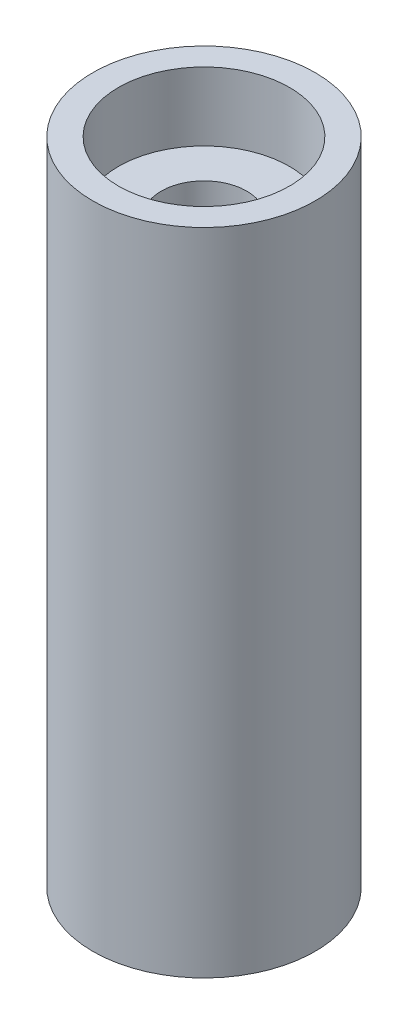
from build123d import *

# Parameters (mm, degrees)
SKETCH_1_R          = 6.5
SKETCH_1_R_2        = 2.5
EXTRUDE_2_DEPTH     = 19
SKETCH_2_R          = 5
CUT_EXTRUDE_1_DEPTH = 4


with BuildPart() as part:
    # Sketch 1 → Extrude 2 (new, symmetric)
    with BuildSketch(Plane(origin=(0, 0, 0), x_dir=(1, 0, 0), z_dir=(0, 1, 0))):
        with Locations(Location((0, 0, 0), (0, 0, 270))):
            Circle(SKETCH_1_R)
        with Locations(Location((0, 0, 0), (0, 0, 270))):
            Circle(SKETCH_1_R_2, mode=Mode.SUBTRACT)
    extrude(amount=EXTRUDE_2_DEPTH, both=True)

    # Sketch 2 → Cut-Extrude 1 (cut)
    with BuildSketch(Plane(origin=(0, 19, 0), x_dir=(1, 0, 0), z_dir=(0, 1, 0))):
        with Locations(Location((0, 0, 0), (0, 0, 270))):
            Circle(SKETCH_2_R)
    cut_extrude_1 = extrude(amount=-CUT_EXTRUDE_1_DEPTH, mode=Mode.SUBTRACT)

    # Mirror 1: Cut-Extrude 1 across plane
    add(cut_extrude_1.mirror(Plane.ZX), mode=Mode.SUBTRACT)


solid = part.part
